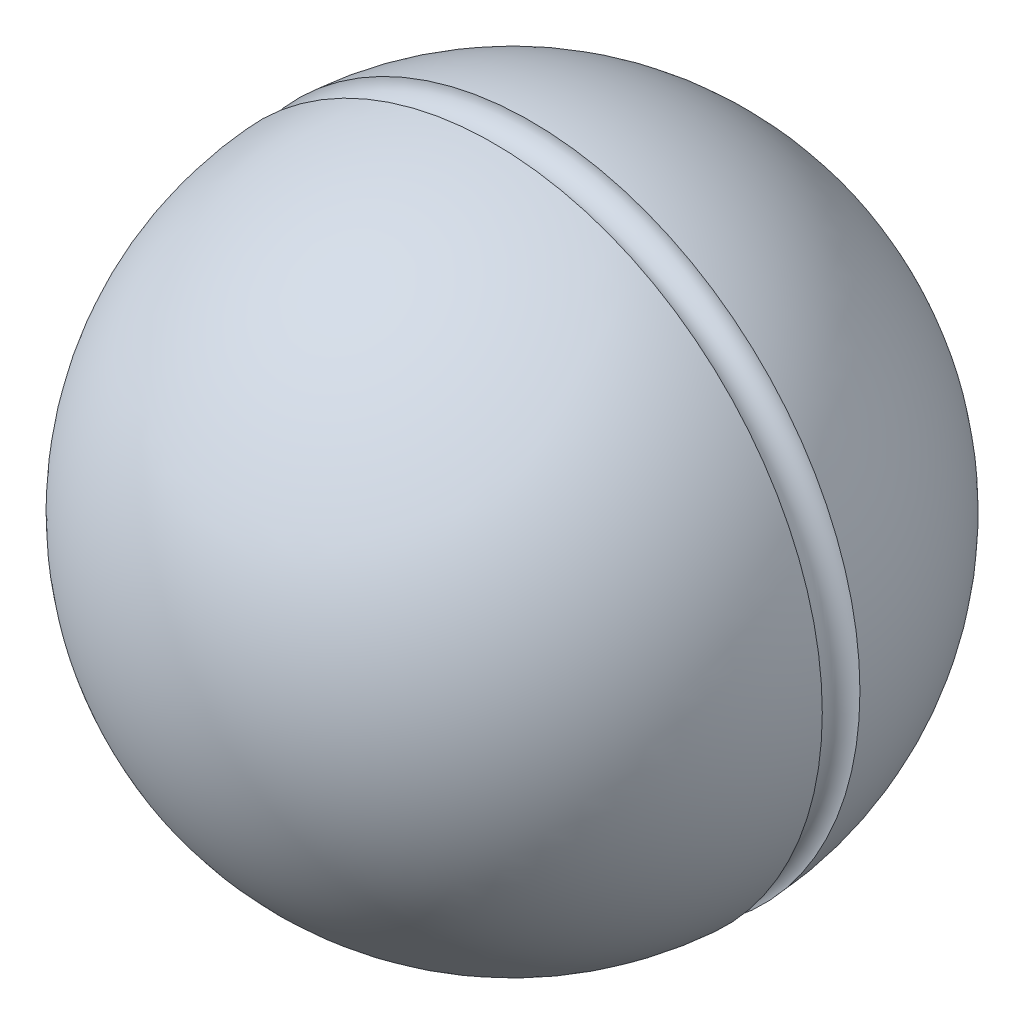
ISO-10303-21;
HEADER;
FILE_DESCRIPTION(('STEP AP214'),'2;1');
FILE_NAME('part.step','',(''),(''),'','','');
FILE_SCHEMA(('AUTOMOTIVE_DESIGN { 1 0 10303 214 1 1 1 1 }'));
ENDSEC;
DATA;
#1=APPLICATION_CONTEXT('core data for automotive mechanical design processes');
#2=APPLICATION_PROTOCOL_DEFINITION('international standard','automotive_design',2000,#1);
#3=PRODUCT_CONTEXT('',#1,'mechanical');
#4=PRODUCT('Part','Part','',(#3));
#5=PRODUCT_RELATED_PRODUCT_CATEGORY('part','',(#4));
#6=PRODUCT_DEFINITION_FORMATION('','',#4);
#7=PRODUCT_DEFINITION_CONTEXT('part definition',#1,'design');
#8=PRODUCT_DEFINITION('design','',#6,#7);
#9=PRODUCT_DEFINITION_SHAPE('','',#8);
#10=(LENGTH_UNIT() NAMED_UNIT(*) SI_UNIT(.MILLI.,.METRE.));
#11=(NAMED_UNIT(*) PLANE_ANGLE_UNIT() SI_UNIT($,.RADIAN.));
#12=(NAMED_UNIT(*) SI_UNIT($,.STERADIAN.) SOLID_ANGLE_UNIT());
#13=UNCERTAINTY_MEASURE_WITH_UNIT(LENGTH_MEASURE(1.E-05),#10,'distance_accuracy_value','');
#14=(GEOMETRIC_REPRESENTATION_CONTEXT(3) GLOBAL_UNCERTAINTY_ASSIGNED_CONTEXT((#13)) GLOBAL_UNIT_ASSIGNED_CONTEXT((#10,
#11,#12)) REPRESENTATION_CONTEXT('',''));
#15=CARTESIAN_POINT('',(0.,0.,0.));
#16=DIRECTION('',(0.,0.,1.));
#17=DIRECTION('',(1.,0.,0.));
#18=AXIS2_PLACEMENT_3D('',#15,#16,#17);
#19=CARTESIAN_POINT('',(0.,0.,15.811388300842));
#20=DIRECTION('',(-1.,0.,0.));
#21=DIRECTION('',(0.,0.,1.));
#22=AXIS2_PLACEMENT_3D('',#19,#20,#21);
#23=SPHERICAL_SURFACE('',#22,17.5);
#24=CARTESIAN_POINT('',(0.,0.,15.811388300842));
#25=DIRECTION('',(0.,0.,1.));
#26=DIRECTION('',(1.,0.,0.));
#27=AXIS2_PLACEMENT_3D('',#24,#25,#26);
#28=SPHERICAL_SURFACE('',#27,17.5);
#29=CARTESIAN_POINT('',(0.,0.,0.));
#30=DIRECTION('',(0.,0.,1.));
#31=DIRECTION('',(1.,0.,0.));
#32=AXIS2_PLACEMENT_3D('',#29,#30,#31);
#33=CIRCLE('',#32,7.5);
#34=CARTESIAN_POINT('',(7.5,0.,0.));
#35=VERTEX_POINT('',#34);
#36=EDGE_CURVE('E8',#35,#35,#33,.T.);
#37=ORIENTED_EDGE('',*,*,#36,.T.);
#38=EDGE_LOOP('',(#37));
#39=FACE_BOUND('',#38,.T.);
#40=CARTESIAN_POINT('',(0.,0.,14.81179654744));
#41=DIRECTION('',(0.,0.,1.));
#42=DIRECTION('',(1.,0.,0.));
#43=AXIS2_PLACEMENT_3D('',#40,#41,#42);
#44=CIRCLE('',#43,17.4714285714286);
#45=CARTESIAN_POINT('',(17.4714285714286,0.,14.81179654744));
#46=VERTEX_POINT('',#45);
#47=EDGE_CURVE('E31',#46,#46,#44,.T.);
#48=ORIENTED_EDGE('',*,*,#47,.F.);
#49=EDGE_LOOP('',(#48));
#50=FACE_BOUND('',#49,.T.);
#51=ADVANCED_FACE('F12',(#39,#50),#28,.T.);
#52=CARTESIAN_POINT('',(0.,5.,0.));
#53=DIRECTION('',(0.,0.,1.));
#54=DIRECTION('',(1.,0.,0.));
#55=AXIS2_PLACEMENT_3D('',#52,#53,#54);
#56=PLANE('',#55);
#57=ORIENTED_EDGE('',*,*,#36,.F.);
#58=EDGE_LOOP('',(#57));
#59=FACE_BOUND('',#58,.T.);
#60=CARTESIAN_POINT('',(0.,0.,0.));
#61=DIRECTION('',(0.,0.,1.));
#62=DIRECTION('',(1.,0.,0.));
#63=AXIS2_PLACEMENT_3D('',#60,#61,#62);
#64=CIRCLE('',#63,5.);
#65=CARTESIAN_POINT('',(5.,0.,0.));
#66=VERTEX_POINT('',#65);
#67=EDGE_CURVE('E18',#66,#66,#64,.T.);
#68=ORIENTED_EDGE('',*,*,#67,.T.);
#69=EDGE_LOOP('',(#68));
#70=FACE_BOUND('',#69,.T.);
#71=ADVANCED_FACE('F38',(#59,#70),#56,.F.);
#72=CARTESIAN_POINT('',(0.,0.,38.311388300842));
#73=DIRECTION('',(0.,0.,1.));
#74=DIRECTION('',(1.,0.,0.));
#75=AXIS2_PLACEMENT_3D('',#72,#73,#74);
#76=CYLINDRICAL_SURFACE('',#75,5.);
#77=CARTESIAN_POINT('',(0.,0.,18.));
#78=DIRECTION('',(0.,0.,1.));
#79=DIRECTION('',(1.,0.,0.));
#80=AXIS2_PLACEMENT_3D('',#77,#78,#79);
#81=CIRCLE('',#80,5.);
#82=CARTESIAN_POINT('',(5.,0.,18.));
#83=VERTEX_POINT('',#82);
#84=EDGE_CURVE('E22',#83,#83,#81,.T.);
#85=ORIENTED_EDGE('',*,*,#84,.T.);
#86=EDGE_LOOP('',(#85));
#87=FACE_BOUND('',#86,.T.);
#88=ORIENTED_EDGE('',*,*,#67,.F.);
#89=EDGE_LOOP('',(#88));
#90=FACE_BOUND('',#89,.T.);
#91=ADVANCED_FACE('F43',(#87,#90),#76,.F.);
#92=CARTESIAN_POINT('',(0.,5.,18.));
#93=DIRECTION('',(0.,0.,-1.));
#94=DIRECTION('',(-1.,0.,0.));
#95=AXIS2_PLACEMENT_3D('',#92,#93,#94);
#96=PLANE('',#95);
#97=ORIENTED_EDGE('',*,*,#84,.F.);
#98=EDGE_LOOP('',(#97));
#99=FACE_BOUND('',#98,.T.);
#100=ADVANCED_FACE('F48',(#99),#96,.T.);
#101=CARTESIAN_POINT('',(0.,0.,15.811388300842));
#102=DIRECTION('',(-1.,0.,0.));
#103=DIRECTION('',(0.,0.,1.));
#104=AXIS2_PLACEMENT_3D('',#101,#102,#103);
#105=SPHERICAL_SURFACE('',#104,17.5);
#106=CARTESIAN_POINT('',(0.,0.,15.811388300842));
#107=DIRECTION('',(0.,0.,1.));
#108=DIRECTION('',(1.,0.,0.));
#109=AXIS2_PLACEMENT_3D('',#106,#107,#108);
#110=SPHERICAL_SURFACE('',#109,17.5);
#111=CARTESIAN_POINT('',(0.,0.,16.810980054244));
#112=DIRECTION('',(0.,0.,1.));
#113=DIRECTION('',(1.,0.,0.));
#114=AXIS2_PLACEMENT_3D('',#111,#112,#113);
#115=CIRCLE('',#114,17.4714285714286);
#116=CARTESIAN_POINT('',(17.4714285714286,0.,16.810980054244));
#117=VERTEX_POINT('',#116);
#118=EDGE_CURVE('E26',#117,#117,#115,.T.);
#119=ORIENTED_EDGE('',*,*,#118,.T.);
#120=EDGE_LOOP('',(#119));
#121=FACE_BOUND('',#120,.T.);
#122=ADVANCED_FACE('F54',(#121),#110,.T.);
#123=CARTESIAN_POINT('',(0.,0.,15.811388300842));
#124=DIRECTION('',(0.,0.,1.));
#125=DIRECTION('',(1.,0.,0.));
#126=AXIS2_PLACEMENT_3D('',#123,#124,#125);
#127=TOROIDAL_SURFACE('',#126,17.5,1.);
#128=ORIENTED_EDGE('',*,*,#118,.F.);
#129=EDGE_LOOP('',(#128));
#130=FACE_BOUND('',#129,.T.);
#131=ORIENTED_EDGE('',*,*,#47,.T.);
#132=EDGE_LOOP('',(#131));
#133=FACE_BOUND('',#132,.T.);
#134=ADVANCED_FACE('F35',(#130,#133),#127,.F.);
#135=CLOSED_SHELL('',(#51,#71,#91,#100,#122,#134));
#136=MANIFOLD_SOLID_BREP('B1',#135);
#137=ADVANCED_BREP_SHAPE_REPRESENTATION('',(#18,#136),#14);
#138=SHAPE_DEFINITION_REPRESENTATION(#9,#137);
ENDSEC;
END-ISO-10303-21;
